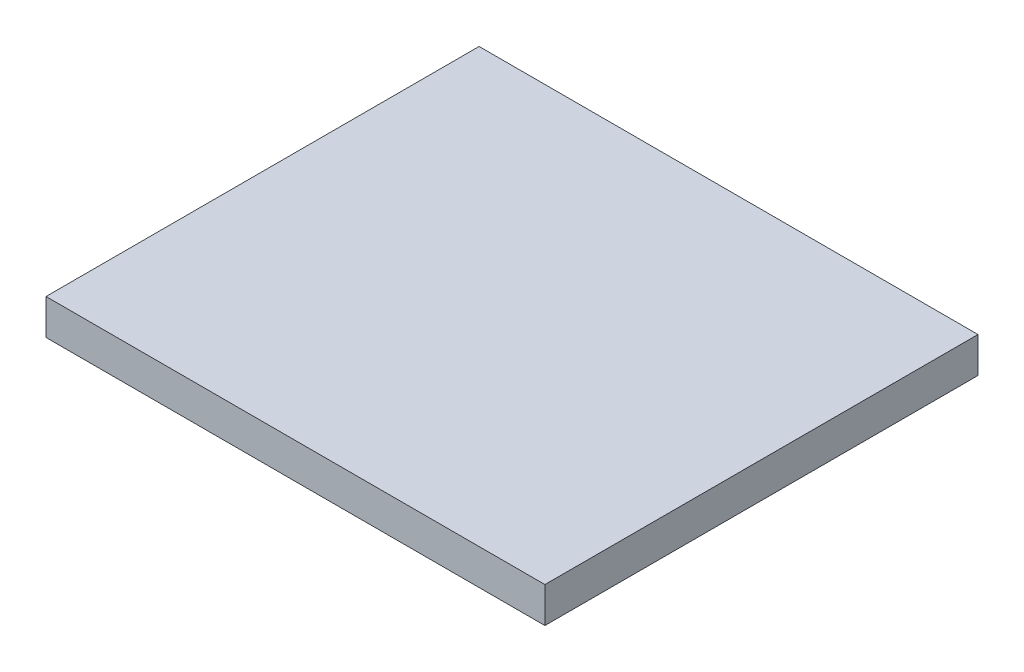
from build123d import *

# Parameters (mm, degrees)
SKIZZE1_W               = 146.302111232
SKIZZE1_H               = 127
LINEAR_AUSTRAGEN1_DEPTH = 10.414


with BuildPart() as part:
    # Skizze1 → Linear austragen1 (new body)
    with BuildSketch(Plane(origin=(0, 0, 0), x_dir=(1, 0, 0), z_dir=(0, 1, 0))):
        with Locations((-45.006316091, 32.617140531)):
            Rectangle(SKIZZE1_W, SKIZZE1_H)
    extrude(amount=LINEAR_AUSTRAGEN1_DEPTH)


solid = part.part
